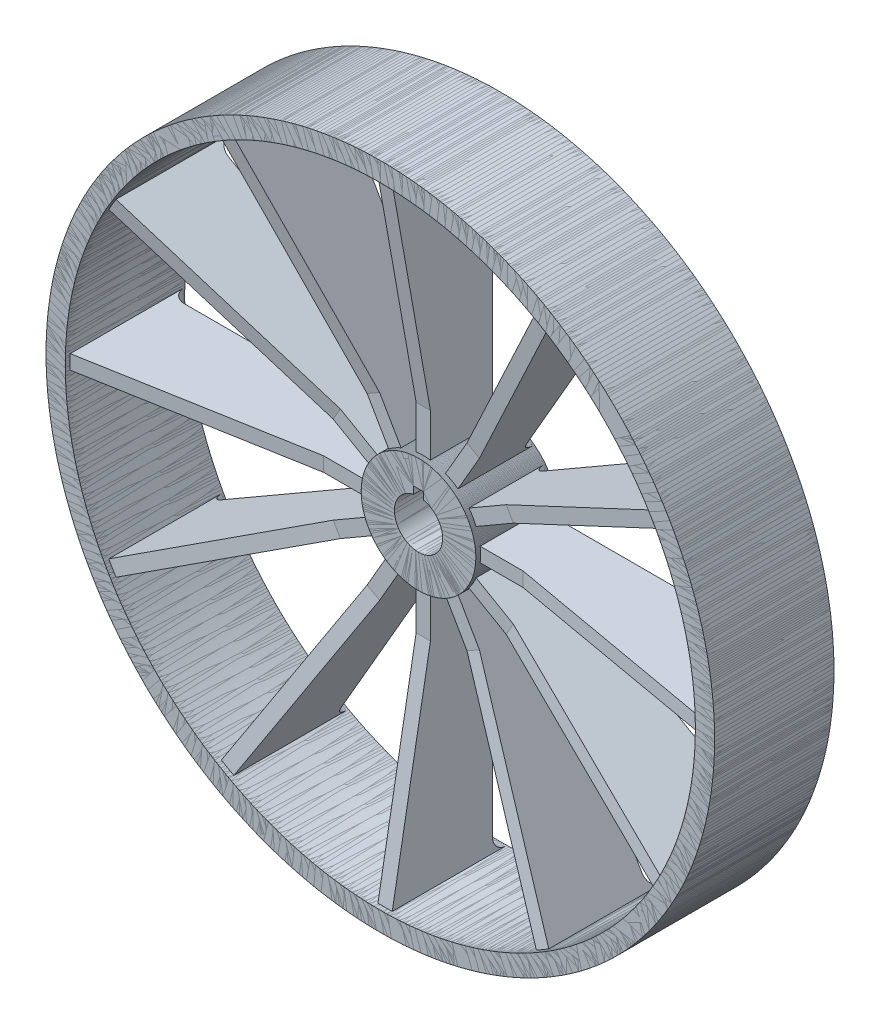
from build123d import *

# Parameters (mm, degrees)
SKETCH_1_R               = 70
SKETCH_1_R_2             = 66
EXTRUDE_1_DEPTH          = 25
SKETCH_1_R_3             = 12
SKETCH_1_R_4             = 5.05
EXTRUDE_1_2_DEPTH        = 25
EXTRUDE_2_DEPTH          = 24
CUT_EXTRUDE_1_REACH      = 106.682
SKETCH_2_W               = 8
SKETCH_2_H               = 9
PATTERN_CIRCULAR_1_COUNT = 12
CUT_EXTRUDE_2_DEPTH      = 25
CUT_EXTRUDE_START        = -8
SKETCH_4_R               = 12
CUT_EXTRUDE_3_DEPTH      = 8


with BuildPart() as part:
    # Sketch 1 → Extrude 1 (new body)
    with BuildSketch(Plane.XY):
        with Locations((-11.767184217, 2.257132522)):
            Circle(SKETCH_1_R)
        with Locations((-11.767184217, 2.257132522)):
            Circle(SKETCH_1_R_2, mode=Mode.SUBTRACT)
    extrude(amount=EXTRUDE_1_DEPTH)



with BuildPart() as body_2:
    # Sketch 1 → Extrude 1 2 (new body)
    with BuildSketch(Plane.XY):
        with Locations((-11.767184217, 2.257132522)):
            Circle(SKETCH_1_R_3)
        with Locations((-11.767184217, 2.257132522)):
            Circle(SKETCH_1_R_4, mode=Mode.SUBTRACT)
    extrude(amount=EXTRUDE_1_2_DEPTH)


with BuildPart() as part_1:
    add(part.part)

    add(body_2.part)  # Extrude 2 merges body 2
    # Sketch 1_3 → Extrude 2 (add)
    with BuildSketch(Plane.XY):
        with BuildLine():
            ThreePointArc((-10.267184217, 68.240084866), (-11.767184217, 68.257132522), (-13.267184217, 68.240084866))
            Line((-13.267184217, 68.240084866), (-13.267184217, 14.163013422))
            ThreePointArc((-13.267184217, 14.163013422), (-11.767184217, 14.257132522), (-10.267184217, 14.163013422))
            Line((-10.267184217, 14.163013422), (-10.267184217, 68.240084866))
        make_face()
    extrude(amount=EXTRUDE_2_DEPTH)

    # Cut-Extrude 1: up to this face of the body (flat: up to its plane)
    cut_extrude_1_end = Plane(part_1.part.faces().sort_by_distance((-13.267184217, 41.201549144, 12))[0])
    # Sketch 2 → Cut-Extrude 1 (cut, up to the picked face)
    with BuildSketch(Plane(origin=(-10.267184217, 0, 0), x_dir=(0, 0, -1), z_dir=(1, 0, 0)), mode=Mode.PRIVATE) as cut_extrude_1_sk1:
        with BuildLine():
            Line((0, 14.163013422), (0, 68.240084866))
            ThreePointArc((0, 68.240084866), (-2.121320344, 67.36140521), (-3, 65.240084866))
            Line((-3, 65.240084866), (-3, 17.163013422))
            ThreePointArc((-3, 17.163013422), (-2.121320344, 15.041693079), (0, 14.163013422))
        make_face()
    cut_extrude_1_tool1 = split(extrude(cut_extrude_1_sk1.sketch, amount=-CUT_EXTRUDE_1_REACH, mode=Mode.PRIVATE), bisect_by=cut_extrude_1_end, keep=Keep.BOTH, mode=Mode.PRIVATE)
    # Sketch 2 → Cut-Extrude 1 (cut, up to the picked face)
    with BuildSketch(Plane(origin=(-10.267184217, 0, 0), x_dir=(0, 0, -1), z_dir=(1, 0, 0)), mode=Mode.PRIVATE) as cut_extrude_1_sk2:
        with Locations((-20, 18.663013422)):
            Rectangle(SKETCH_2_W, SKETCH_2_H)
    cut_extrude_1_tool2 = split(extrude(cut_extrude_1_sk2.sketch, amount=-CUT_EXTRUDE_1_REACH, mode=Mode.PRIVATE), bisect_by=cut_extrude_1_end, keep=Keep.BOTH, mode=Mode.PRIVATE)
    # Sketch 2 → Cut-Extrude 1 (cut, up to the picked face)
    with BuildSketch(Plane(origin=(-10.267184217, 0, 0), x_dir=(0, 0, -1), z_dir=(1, 0, 0)), mode=Mode.PRIVATE) as cut_extrude_1_sk3:
        Polygon((-16, 23.163013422), (-24, 68.240084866), (-24, 23.163013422), align=None)
    cut_extrude_1_tool3 = split(extrude(cut_extrude_1_sk3.sketch, amount=-CUT_EXTRUDE_1_REACH, mode=Mode.PRIVATE), bisect_by=cut_extrude_1_end, keep=Keep.BOTH, mode=Mode.PRIVATE)
    add(cut_extrude_1_tool1.solids().sort_by(Axis((-10.267184, 41.201549, 1.479758), (-1, 0, 0)))[0], mode=Mode.SUBTRACT)
    add(cut_extrude_1_tool2.solids().sort_by(Axis((-10.267184, 18.663013, 20), (-1, 0, 0)))[0], mode=Mode.SUBTRACT)
    add(cut_extrude_1_tool3.solids().sort_by(Axis((-10.267184, 38.188704, 21.333333), (-1, 0, 0)))[0], mode=Mode.SUBTRACT)


with BuildPart() as pattern_circular_1_1:
    # Pattern Circular 1: pattern copy
    add(part_1.part.rotate(Axis((-11.767184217, 2.257132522, 0), (0, 0, 1)), 1 * 360 / PATTERN_CIRCULAR_1_COUNT))


with BuildPart() as pattern_circular_1_2:
    # Pattern Circular 1: pattern copy
    add(part_1.part.rotate(Axis((-11.767184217, 2.257132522, 0), (0, 0, 1)), 2 * 360 / PATTERN_CIRCULAR_1_COUNT))


with BuildPart() as pattern_circular_1_3:
    # Pattern Circular 1: pattern copy
    add(part_1.part.rotate(Axis((-11.767184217, 2.257132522, 0), (0, 0, 1)), 3 * 360 / PATTERN_CIRCULAR_1_COUNT))


with BuildPart() as pattern_circular_1_4:
    # Pattern Circular 1: pattern copy
    add(part_1.part.rotate(Axis((-11.767184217, 2.257132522, 0), (0, 0, 1)), 4 * 360 / PATTERN_CIRCULAR_1_COUNT))


with BuildPart() as pattern_circular_1_5:
    # Pattern Circular 1: pattern copy
    add(part_1.part.rotate(Axis((-11.767184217, 2.257132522, 0), (0, 0, 1)), 5 * 360 / PATTERN_CIRCULAR_1_COUNT))


with BuildPart() as pattern_circular_1_6:
    # Pattern Circular 1: pattern copy
    add(part_1.part.rotate(Axis((-11.767184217, 2.257132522, 0), (0, 0, 1)), 6 * 360 / PATTERN_CIRCULAR_1_COUNT))


with BuildPart() as pattern_circular_1_7:
    # Pattern Circular 1: pattern copy
    add(part_1.part.rotate(Axis((-11.767184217, 2.257132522, 0), (0, 0, 1)), 7 * 360 / PATTERN_CIRCULAR_1_COUNT))


with BuildPart() as pattern_circular_1_8:
    # Pattern Circular 1: pattern copy
    add(part_1.part.rotate(Axis((-11.767184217, 2.257132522, 0), (0, 0, 1)), 8 * 360 / PATTERN_CIRCULAR_1_COUNT))


with BuildPart() as pattern_circular_1_9:
    # Pattern Circular 1: pattern copy
    add(part_1.part.rotate(Axis((-11.767184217, 2.257132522, 0), (0, 0, 1)), 9 * 360 / PATTERN_CIRCULAR_1_COUNT))


with BuildPart() as pattern_circular_1_10:
    # Pattern Circular 1: pattern copy
    add(part_1.part.rotate(Axis((-11.767184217, 2.257132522, 0), (0, 0, 1)), 10 * 360 / PATTERN_CIRCULAR_1_COUNT))


with BuildPart() as pattern_circular_1_11:
    # Pattern Circular 1: pattern copy
    add(part_1.part.rotate(Axis((-11.767184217, 2.257132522, 0), (0, 0, 1)), 11 * 360 / PATTERN_CIRCULAR_1_COUNT))


with BuildPart() as cut_extrude_2_tool:
    # Sketch 3 → Cut-Extrude 2 (new body)
    with BuildSketch(Plane(origin=(0, 0, 0), x_dir=(-1, 0, 0), z_dir=(0, 0, -1))):
        with BuildLine():
            Line((12.767184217, 8.707132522), (10.767184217, 8.707132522))
            Line((10.767184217, 8.707132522), (10.767184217, 7.207132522))
            ThreePointArc((10.767184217, 7.207132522), (11.767184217, 7.307132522), (12.767184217, 7.207132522))
            Line((12.767184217, 7.207132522), (12.767184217, 8.707132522))
        make_face()
    extrude(amount=-CUT_EXTRUDE_2_DEPTH)


with BuildPart() as part_2:
    add(part_1.part)

    # Cut-Extrude 2: cut by cut_extrude_2_tool
    add(cut_extrude_2_tool.part, mode=Mode.SUBTRACT)


with BuildPart() as pattern_circular_1_1_1:
    add(pattern_circular_1_1.part)

    # Cut-Extrude 2: cut by cut_extrude_2_tool
    add(cut_extrude_2_tool.part, mode=Mode.SUBTRACT)


with BuildPart() as pattern_circular_1_2_1:
    add(pattern_circular_1_2.part)

    # Cut-Extrude 2: cut by cut_extrude_2_tool
    add(cut_extrude_2_tool.part, mode=Mode.SUBTRACT)


with BuildPart() as pattern_circular_1_3_1:
    add(pattern_circular_1_3.part)

    # Cut-Extrude 2: cut by cut_extrude_2_tool
    add(cut_extrude_2_tool.part, mode=Mode.SUBTRACT)


with BuildPart() as pattern_circular_1_4_1:
    add(pattern_circular_1_4.part)

    # Cut-Extrude 2: cut by cut_extrude_2_tool
    add(cut_extrude_2_tool.part, mode=Mode.SUBTRACT)


with BuildPart() as pattern_circular_1_5_1:
    add(pattern_circular_1_5.part)

    # Cut-Extrude 2: cut by cut_extrude_2_tool
    add(cut_extrude_2_tool.part, mode=Mode.SUBTRACT)


with BuildPart() as pattern_circular_1_6_1:
    add(pattern_circular_1_6.part)

    # Cut-Extrude 2: cut by cut_extrude_2_tool
    add(cut_extrude_2_tool.part, mode=Mode.SUBTRACT)


with BuildPart() as pattern_circular_1_7_1:
    add(pattern_circular_1_7.part)

    # Cut-Extrude 2: cut by cut_extrude_2_tool
    add(cut_extrude_2_tool.part, mode=Mode.SUBTRACT)


with BuildPart() as pattern_circular_1_8_1:
    add(pattern_circular_1_8.part)

    # Cut-Extrude 2: cut by cut_extrude_2_tool
    add(cut_extrude_2_tool.part, mode=Mode.SUBTRACT)


with BuildPart() as pattern_circular_1_9_1:
    add(pattern_circular_1_9.part)

    # Cut-Extrude 2: cut by cut_extrude_2_tool
    add(cut_extrude_2_tool.part, mode=Mode.SUBTRACT)


with BuildPart() as pattern_circular_1_10_1:
    add(pattern_circular_1_10.part)

    # Cut-Extrude 2: cut by cut_extrude_2_tool
    add(cut_extrude_2_tool.part, mode=Mode.SUBTRACT)


with BuildPart() as pattern_circular_1_11_1:
    add(pattern_circular_1_11.part)

    # Cut-Extrude 2: cut by cut_extrude_2_tool
    add(cut_extrude_2_tool.part, mode=Mode.SUBTRACT)


with BuildPart() as cut_extrude_3_tool:
    # Sketch 4 → Cut-Extrude 3 (new body)
    with BuildSketch(Plane.XY.offset(25).offset(CUT_EXTRUDE_START)):
        with Locations((-11.767184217, 2.257132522)):
            Circle(SKETCH_4_R)
    extrude(amount=CUT_EXTRUDE_3_DEPTH)


with BuildPart() as part_3:
    add(part_2.part)

    # Cut-Extrude 3: cut by cut_extrude_3_tool
    add(cut_extrude_3_tool.part, mode=Mode.SUBTRACT)


with BuildPart() as pattern_circular_1_1_2:
    add(pattern_circular_1_1_1.part)

    # Cut-Extrude 3: cut by cut_extrude_3_tool
    add(cut_extrude_3_tool.part, mode=Mode.SUBTRACT)


with BuildPart() as pattern_circular_1_2_2:
    add(pattern_circular_1_2_1.part)

    # Cut-Extrude 3: cut by cut_extrude_3_tool
    add(cut_extrude_3_tool.part, mode=Mode.SUBTRACT)


with BuildPart() as pattern_circular_1_3_2:
    add(pattern_circular_1_3_1.part)

    # Cut-Extrude 3: cut by cut_extrude_3_tool
    add(cut_extrude_3_tool.part, mode=Mode.SUBTRACT)


with BuildPart() as pattern_circular_1_4_2:
    add(pattern_circular_1_4_1.part)

    # Cut-Extrude 3: cut by cut_extrude_3_tool
    add(cut_extrude_3_tool.part, mode=Mode.SUBTRACT)


with BuildPart() as pattern_circular_1_5_2:
    add(pattern_circular_1_5_1.part)

    # Cut-Extrude 3: cut by cut_extrude_3_tool
    add(cut_extrude_3_tool.part, mode=Mode.SUBTRACT)


with BuildPart() as pattern_circular_1_6_2:
    add(pattern_circular_1_6_1.part)

    # Cut-Extrude 3: cut by cut_extrude_3_tool
    add(cut_extrude_3_tool.part, mode=Mode.SUBTRACT)


with BuildPart() as pattern_circular_1_7_2:
    add(pattern_circular_1_7_1.part)

    # Cut-Extrude 3: cut by cut_extrude_3_tool
    add(cut_extrude_3_tool.part, mode=Mode.SUBTRACT)


with BuildPart() as pattern_circular_1_8_2:
    add(pattern_circular_1_8_1.part)

    # Cut-Extrude 3: cut by cut_extrude_3_tool
    add(cut_extrude_3_tool.part, mode=Mode.SUBTRACT)


with BuildPart() as pattern_circular_1_9_2:
    add(pattern_circular_1_9_1.part)

    # Cut-Extrude 3: cut by cut_extrude_3_tool
    add(cut_extrude_3_tool.part, mode=Mode.SUBTRACT)


with BuildPart() as pattern_circular_1_10_2:
    add(pattern_circular_1_10_1.part)

    # Cut-Extrude 3: cut by cut_extrude_3_tool
    add(cut_extrude_3_tool.part, mode=Mode.SUBTRACT)


with BuildPart() as pattern_circular_1_11_2:
    add(pattern_circular_1_11_1.part)

    # Cut-Extrude 3: cut by cut_extrude_3_tool
    add(cut_extrude_3_tool.part, mode=Mode.SUBTRACT)


solid = Compound([part_3.part, pattern_circular_1_1_2.part, pattern_circular_1_2_2.part, pattern_circular_1_3_2.part, pattern_circular_1_4_2.part, pattern_circular_1_5_2.part, pattern_circular_1_6_2.part, pattern_circular_1_7_2.part, pattern_circular_1_8_2.part, pattern_circular_1_9_2.part, pattern_circular_1_10_2.part, pattern_circular_1_11_2.part])
